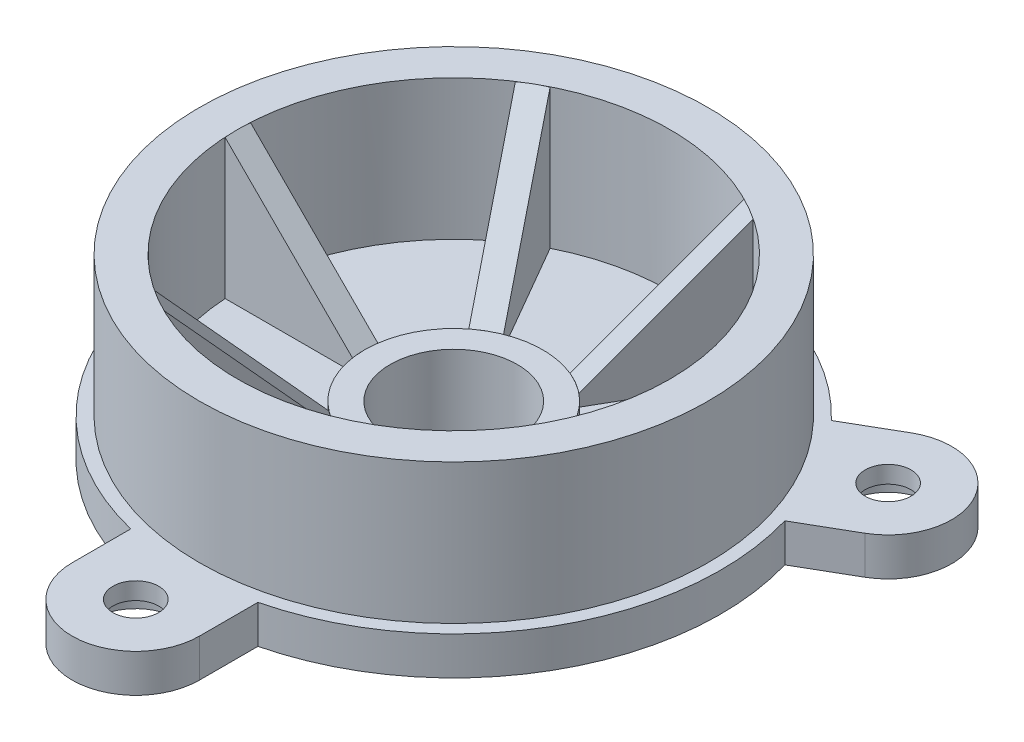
from build123d import *
from build123d.topology import SkipClean

# Parameters (mm, degrees)
BOSS_EXTRUDE1_START             = -3
BOSS_EXTRUDE1_DEPTH             = 3
CBORE_FOR_M3_SBHCS1_D           = 3.6
CBORE_FOR_M3_SBHCS1_CBORE_D     = 6.7
CBORE_FOR_M3_SBHCS1_CBORE_DEPTH = 1.65
CIRPATTERN1_COUNT               = 3
RIB1_REACH                      = 45.2
SKETCH5_WALL_W                  = 102.542514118
SKETCH5_WALL_H                  = 2
CIRPATTERN2_COUNT               = 6


with BuildPart() as part:
    # Sketch1 → Revolve1 (revolve)
    with BuildSketch(Plane.XY, mode=Mode.PRIVATE) as revolve1_sk:
        Polygon((5, 0), (5, 6), (7, 6), (7, 5), (17, 5), (17, 16), (20, 16), (20, 5), (21, 5), (21, 2), (10, 2), (10, 0), align=None)
    revolve(revolve1_sk.sketch.rotate(Axis((0, 91.924294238, 0), (0, -1, 0)), 90), axis=Axis((0, 91.924294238, 0), (0, -1, 0)))

    # Sketch2 → Boss-Extrude1 (add)
    with BuildSketch(Plane(origin=(0, 5, 0), x_dir=(1, 0, 0), z_dir=(0, 1, 0)).offset(BOSS_EXTRUDE1_START)):
        with BuildLine():
            Line((-5, -19.364916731), (-5, -25))
            ThreePointArc((-5, -25), (0, -30), (5, -25))
            Line((5, -25), (5, -19.364916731))
            ThreePointArc((5, -19.364916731), (0, -20), (-5, -19.364916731))
        make_face()
    boss_extrude1 = extrude(amount=BOSS_EXTRUDE1_DEPTH)

    # CBORE for M3 SBHCS1 (through all)
    with Locations(Plane.XZ.offset(-2)):
        with Locations((0, 25)):
            cbore_for_m3_sbhcs1 = CounterBoreHole(CBORE_FOR_M3_SBHCS1_D / 2, CBORE_FOR_M3_SBHCS1_CBORE_D / 2, CBORE_FOR_M3_SBHCS1_CBORE_DEPTH)

    # CirPattern1: Boss-Extrude1, CBORE for M3 SBHCS1 ×3 about axis
    cirpattern1_axis = Axis((0, 0, 0), (0, 1, 0))
    add([boss_extrude1.rotate(cirpattern1_axis, i * 360 / CIRPATTERN1_COUNT) for i in range(1, CIRPATTERN1_COUNT)])
    add([cbore_for_m3_sbhcs1.rotate(cirpattern1_axis, i * 360 / CIRPATTERN1_COUNT) for i in range(1, CIRPATTERN1_COUNT)], mode=Mode.SUBTRACT)

    # Sketch5 wall → Rib1 (add, up to next)
    with BuildSketch(Plane(origin=(-12, 11, 0), x_dir=(0.707106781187, -0.707106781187, 0), z_dir=(0.707106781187, 0.707106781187, 0)), mode=Mode.PRIVATE) as rib1_sk1:
        Rectangle(SKETCH5_WALL_W, SKETCH5_WALL_H)
    rib1_tool1 = extrude(rib1_sk1.sketch, amount=-RIB1_REACH, mode=Mode.PRIVATE) - part.part
    rib1 = rib1_tool1.solids().sort_by_distance((-12, 11, 0))[0]
    add(rib1)

    # CirPattern2: Rib1 ×6 about axis
    with SkipClean():  # the faces are left unmerged after this step: merging them gives an invalid solid
        cirpattern2_axis = Axis((0, 0, 0), (0, 1, 0))
        for i in range(1, CIRPATTERN2_COUNT):
            add(rib1.rotate(cirpattern2_axis, i * 360 / CIRPATTERN2_COUNT))


solid = part.part
